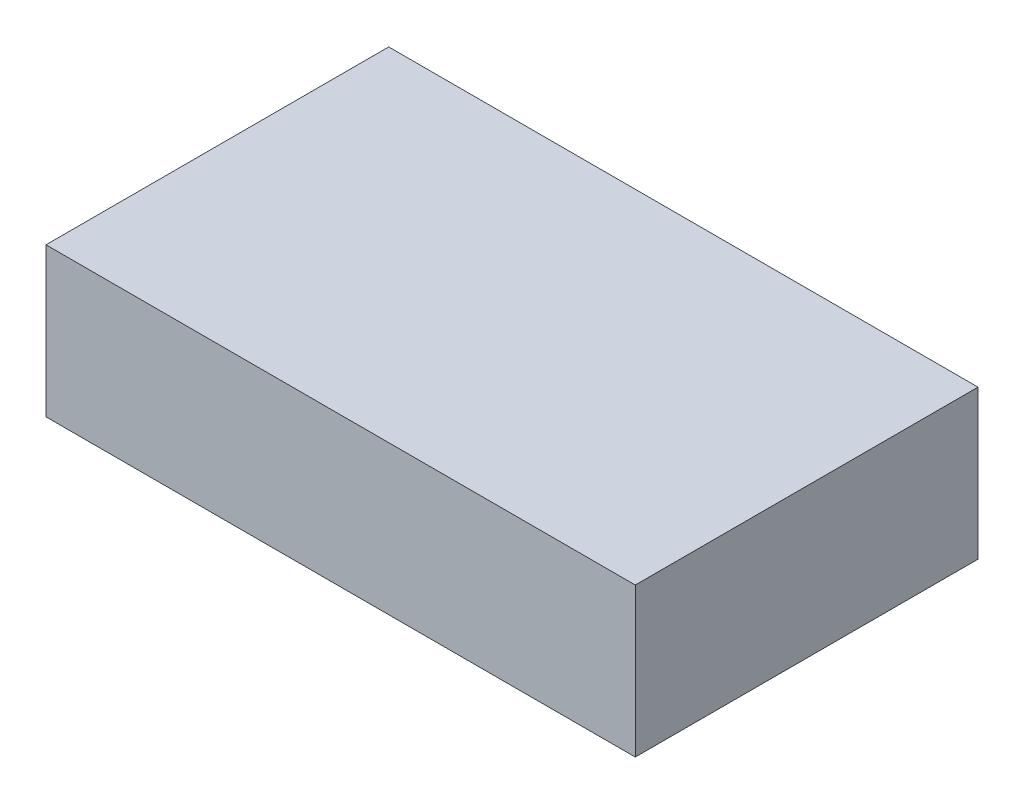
ISO-10303-21;
HEADER;
FILE_DESCRIPTION(('STEP AP214'),'2;1');
FILE_NAME('part.step','',(''),(''),'','','');
FILE_SCHEMA(('AUTOMOTIVE_DESIGN { 1 0 10303 214 1 1 1 1 }'));
ENDSEC;
DATA;
#1=APPLICATION_CONTEXT('core data for automotive mechanical design processes');
#2=APPLICATION_PROTOCOL_DEFINITION('international standard','automotive_design',2000,#1);
#3=PRODUCT_CONTEXT('',#1,'mechanical');
#4=PRODUCT('Part','Part','',(#3));
#5=PRODUCT_RELATED_PRODUCT_CATEGORY('part','',(#4));
#6=PRODUCT_DEFINITION_FORMATION('','',#4);
#7=PRODUCT_DEFINITION_CONTEXT('part definition',#1,'design');
#8=PRODUCT_DEFINITION('design','',#6,#7);
#9=PRODUCT_DEFINITION_SHAPE('','',#8);
#10=(LENGTH_UNIT() NAMED_UNIT(*) SI_UNIT(.MILLI.,.METRE.));
#11=(NAMED_UNIT(*) PLANE_ANGLE_UNIT() SI_UNIT($,.RADIAN.));
#12=(NAMED_UNIT(*) SI_UNIT($,.STERADIAN.) SOLID_ANGLE_UNIT());
#13=UNCERTAINTY_MEASURE_WITH_UNIT(LENGTH_MEASURE(1.E-05),#10,'distance_accuracy_value','');
#14=(GEOMETRIC_REPRESENTATION_CONTEXT(3) GLOBAL_UNCERTAINTY_ASSIGNED_CONTEXT((#13)) GLOBAL_UNIT_ASSIGNED_CONTEXT((#10,
#11,#12)) REPRESENTATION_CONTEXT('',''));
#15=CARTESIAN_POINT('',(0.,0.,0.));
#16=DIRECTION('',(0.,0.,1.));
#17=DIRECTION('',(1.,0.,0.));
#18=AXIS2_PLACEMENT_3D('',#15,#16,#17);
#19=CARTESIAN_POINT('',(0.,0.,50.6));
#20=DIRECTION('',(1.,0.,0.));
#21=DIRECTION('',(0.,1.,0.));
#22=AXIS2_PLACEMENT_3D('',#19,#20,#21);
#23=PLANE('',#22);
#24=DIRECTION('',(0.,-1.,0.));
#25=VECTOR('',#24,1.);
#26=CARTESIAN_POINT('',(0.,0.,0.));
#27=LINE('',#26,#25);
#28=CARTESIAN_POINT('',(0.,22.,0.));
#29=VERTEX_POINT('',#28);
#30=CARTESIAN_POINT('',(0.,0.,0.));
#31=VERTEX_POINT('',#30);
#32=EDGE_CURVE('E93',#29,#31,#27,.T.);
#33=ORIENTED_EDGE('',*,*,#32,.T.);
#34=DIRECTION('',(0.,0.,-1.));
#35=VECTOR('',#34,1.);
#36=CARTESIAN_POINT('',(0.,0.,50.6));
#37=LINE('',#36,#35);
#38=CARTESIAN_POINT('',(0.,0.,50.6));
#39=VERTEX_POINT('',#38);
#40=EDGE_CURVE('E11',#39,#31,#37,.T.);
#41=ORIENTED_EDGE('',*,*,#40,.F.);
#42=DIRECTION('',(0.,-1.,0.));
#43=VECTOR('',#42,1.);
#44=CARTESIAN_POINT('',(0.,0.,50.6));
#45=LINE('',#44,#43);
#46=CARTESIAN_POINT('',(0.,22.,50.6));
#47=VERTEX_POINT('',#46);
#48=EDGE_CURVE('E81',#47,#39,#45,.T.);
#49=ORIENTED_EDGE('',*,*,#48,.F.);
#50=DIRECTION('',(0.,0.,-1.));
#51=VECTOR('',#50,1.);
#52=CARTESIAN_POINT('',(0.,22.,50.6));
#53=LINE('',#52,#51);
#54=EDGE_CURVE('E89',#47,#29,#53,.T.);
#55=ORIENTED_EDGE('',*,*,#54,.T.);
#56=EDGE_LOOP('',(#33,#41,#49,#55));
#57=FACE_BOUND('',#56,.T.);
#58=ADVANCED_FACE('F30',(#57),#23,.F.);
#59=CARTESIAN_POINT('',(0.,0.,50.6));
#60=DIRECTION('',(0.,1.,0.));
#61=DIRECTION('',(0.,0.,1.));
#62=AXIS2_PLACEMENT_3D('',#59,#60,#61);
#63=PLANE('',#62);
#64=DIRECTION('',(1.,0.,0.));
#65=VECTOR('',#64,1.);
#66=CARTESIAN_POINT('',(0.,0.,0.));
#67=LINE('',#66,#65);
#68=CARTESIAN_POINT('',(87.,0.,0.));
#69=VERTEX_POINT('',#68);
#70=EDGE_CURVE('E85',#31,#69,#67,.T.);
#71=ORIENTED_EDGE('',*,*,#70,.T.);
#72=DIRECTION('',(0.,0.,-1.));
#73=VECTOR('',#72,1.);
#74=CARTESIAN_POINT('',(87.,0.,50.6));
#75=LINE('',#74,#73);
#76=CARTESIAN_POINT('',(87.,0.,50.6));
#77=VERTEX_POINT('',#76);
#78=EDGE_CURVE('E38',#77,#69,#75,.T.);
#79=ORIENTED_EDGE('',*,*,#78,.F.);
#80=DIRECTION('',(1.,0.,0.));
#81=VECTOR('',#80,1.);
#82=CARTESIAN_POINT('',(0.,0.,50.6));
#83=LINE('',#82,#81);
#84=EDGE_CURVE('E76',#39,#77,#83,.T.);
#85=ORIENTED_EDGE('',*,*,#84,.F.);
#86=ORIENTED_EDGE('',*,*,#40,.T.);
#87=EDGE_LOOP('',(#71,#79,#85,#86));
#88=FACE_BOUND('',#87,.T.);
#89=ADVANCED_FACE('F84',(#88),#63,.F.);
#90=CARTESIAN_POINT('',(87.,0.,50.6));
#91=DIRECTION('',(-1.,0.,0.));
#92=DIRECTION('',(0.,-1.,0.));
#93=AXIS2_PLACEMENT_3D('',#90,#91,#92);
#94=PLANE('',#93);
#95=DIRECTION('',(0.,1.,0.));
#96=VECTOR('',#95,1.);
#97=CARTESIAN_POINT('',(87.,0.,0.));
#98=LINE('',#97,#96);
#99=CARTESIAN_POINT('',(87.,22.,0.));
#100=VERTEX_POINT('',#99);
#101=EDGE_CURVE('E63',#69,#100,#98,.T.);
#102=ORIENTED_EDGE('',*,*,#101,.T.);
#103=DIRECTION('',(0.,0.,-1.));
#104=VECTOR('',#103,1.);
#105=CARTESIAN_POINT('',(87.,22.,50.6));
#106=LINE('',#105,#104);
#107=CARTESIAN_POINT('',(87.,22.,50.6));
#108=VERTEX_POINT('',#107);
#109=EDGE_CURVE('E86',#108,#100,#106,.T.);
#110=ORIENTED_EDGE('',*,*,#109,.F.);
#111=DIRECTION('',(0.,1.,0.));
#112=VECTOR('',#111,1.);
#113=CARTESIAN_POINT('',(87.,0.,50.6));
#114=LINE('',#113,#112);
#115=EDGE_CURVE('E79',#77,#108,#114,.T.);
#116=ORIENTED_EDGE('',*,*,#115,.F.);
#117=ORIENTED_EDGE('',*,*,#78,.T.);
#118=EDGE_LOOP('',(#102,#110,#116,#117));
#119=FACE_BOUND('',#118,.T.);
#120=ADVANCED_FACE('F87',(#119),#94,.F.);
#121=CARTESIAN_POINT('',(0.,22.,50.6));
#122=DIRECTION('',(0.,-1.,0.));
#123=DIRECTION('',(0.,0.,-1.));
#124=AXIS2_PLACEMENT_3D('',#121,#122,#123);
#125=PLANE('',#124);
#126=DIRECTION('',(-1.,0.,0.));
#127=VECTOR('',#126,1.);
#128=CARTESIAN_POINT('',(0.,22.,0.));
#129=LINE('',#128,#127);
#130=EDGE_CURVE('E69',#100,#29,#129,.T.);
#131=ORIENTED_EDGE('',*,*,#130,.T.);
#132=ORIENTED_EDGE('',*,*,#54,.F.);
#133=DIRECTION('',(-1.,0.,0.));
#134=VECTOR('',#133,1.);
#135=CARTESIAN_POINT('',(0.,22.,50.6));
#136=LINE('',#135,#134);
#137=EDGE_CURVE('E46',#108,#47,#136,.T.);
#138=ORIENTED_EDGE('',*,*,#137,.F.);
#139=ORIENTED_EDGE('',*,*,#109,.T.);
#140=EDGE_LOOP('',(#131,#132,#138,#139));
#141=FACE_BOUND('',#140,.T.);
#142=ADVANCED_FACE('F100',(#141),#125,.F.);
#143=CARTESIAN_POINT('',(0.,22.,50.6));
#144=DIRECTION('',(0.,0.,-1.));
#145=DIRECTION('',(-1.,0.,0.));
#146=AXIS2_PLACEMENT_3D('',#143,#144,#145);
#147=PLANE('',#146);
#148=ORIENTED_EDGE('',*,*,#48,.T.);
#149=ORIENTED_EDGE('',*,*,#84,.T.);
#150=ORIENTED_EDGE('',*,*,#115,.T.);
#151=ORIENTED_EDGE('',*,*,#137,.T.);
#152=EDGE_LOOP('',(#148,#149,#150,#151));
#153=FACE_BOUND('',#152,.T.);
#154=ADVANCED_FACE('F77',(#153),#147,.F.);
#155=CARTESIAN_POINT('',(0.,22.,0.));
#156=DIRECTION('',(0.,0.,-1.));
#157=DIRECTION('',(-1.,0.,0.));
#158=AXIS2_PLACEMENT_3D('',#155,#156,#157);
#159=PLANE('',#158);
#160=ORIENTED_EDGE('',*,*,#32,.F.);
#161=ORIENTED_EDGE('',*,*,#130,.F.);
#162=ORIENTED_EDGE('',*,*,#101,.F.);
#163=ORIENTED_EDGE('',*,*,#70,.F.);
#164=EDGE_LOOP('',(#160,#161,#162,#163));
#165=FACE_BOUND('',#164,.T.);
#166=ADVANCED_FACE('F103',(#165),#159,.T.);
#167=CLOSED_SHELL('',(#58,#89,#120,#142,#154,#166));
#168=MANIFOLD_SOLID_BREP('B2',#167);
#169=ADVANCED_BREP_SHAPE_REPRESENTATION('',(#18,#168),#14);
#170=SHAPE_DEFINITION_REPRESENTATION(#9,#169);
ENDSEC;
END-ISO-10303-21;
